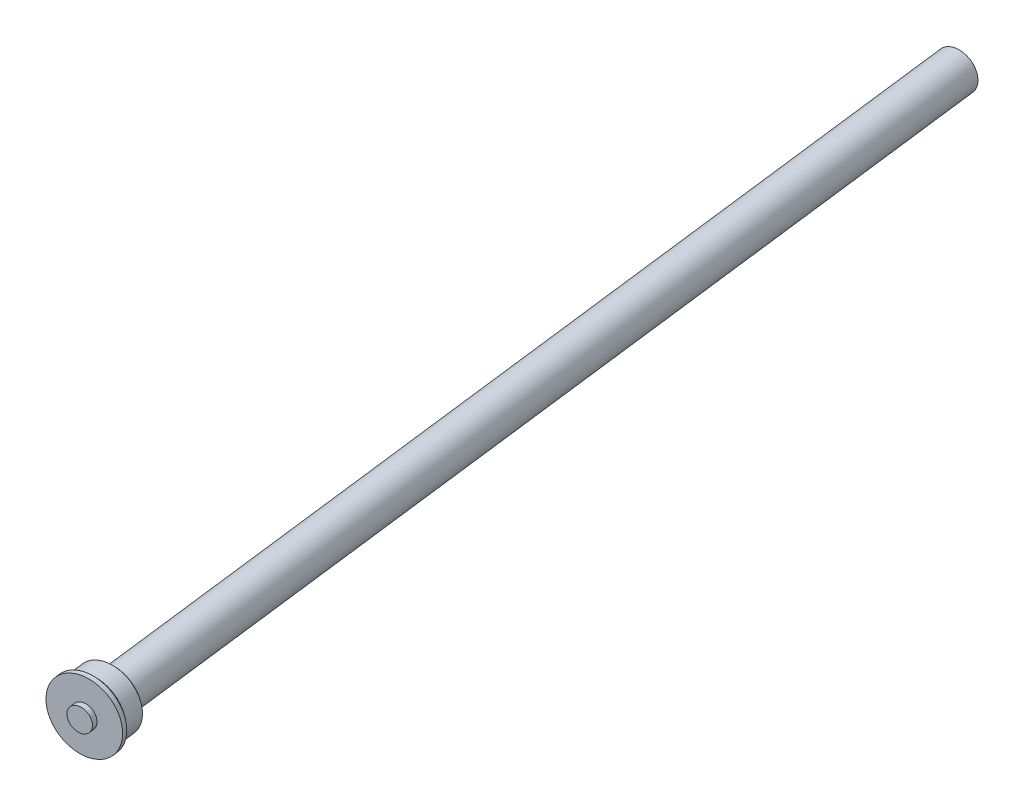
ISO-10303-21;
HEADER;
FILE_DESCRIPTION(('STEP AP214'),'2;1');
FILE_NAME('part.step','',(''),(''),'','','');
FILE_SCHEMA(('AUTOMOTIVE_DESIGN { 1 0 10303 214 1 1 1 1 }'));
ENDSEC;
DATA;
#1=APPLICATION_CONTEXT('core data for automotive mechanical design processes');
#2=APPLICATION_PROTOCOL_DEFINITION('international standard','automotive_design',2000,#1);
#3=PRODUCT_CONTEXT('',#1,'mechanical');
#4=PRODUCT('Part','Part','',(#3));
#5=PRODUCT_RELATED_PRODUCT_CATEGORY('part','',(#4));
#6=PRODUCT_DEFINITION_FORMATION('','',#4);
#7=PRODUCT_DEFINITION_CONTEXT('part definition',#1,'design');
#8=PRODUCT_DEFINITION('design','',#6,#7);
#9=PRODUCT_DEFINITION_SHAPE('','',#8);
#10=(LENGTH_UNIT() NAMED_UNIT(*) SI_UNIT(.MILLI.,.METRE.));
#11=(NAMED_UNIT(*) PLANE_ANGLE_UNIT() SI_UNIT($,.RADIAN.));
#12=(NAMED_UNIT(*) SI_UNIT($,.STERADIAN.) SOLID_ANGLE_UNIT());
#13=UNCERTAINTY_MEASURE_WITH_UNIT(LENGTH_MEASURE(1.E-05),#10,'distance_accuracy_value','');
#14=(GEOMETRIC_REPRESENTATION_CONTEXT(3) GLOBAL_UNCERTAINTY_ASSIGNED_CONTEXT((#13)) GLOBAL_UNIT_ASSIGNED_CONTEXT((#10,
#11,#12)) REPRESENTATION_CONTEXT('',''));
#15=CARTESIAN_POINT('',(0.,0.,0.));
#16=DIRECTION('',(0.,0.,1.));
#17=DIRECTION('',(1.,0.,0.));
#18=AXIS2_PLACEMENT_3D('',#15,#16,#17);
#19=CARTESIAN_POINT('',(92.8753429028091,-2.85362011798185E-13,-206.071733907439));
#20=DIRECTION('',(0.122564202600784,0.,0.992460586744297));
#21=DIRECTION('',(-0.992407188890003,0.0103732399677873,0.122557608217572));
#22=AXIS2_PLACEMENT_3D('',#19,#20,#21);
#23=CONICAL_SURFACE('',#22,19.,0.785398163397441);
#24=CARTESIAN_POINT('',(92.9979071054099,-2.86012533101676E-13,-205.079273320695));
#25=DIRECTION('',(-0.122564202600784,0.,-0.992460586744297));
#26=DIRECTION('',(0.992407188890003,-0.0103732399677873,-0.122557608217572));
#27=AXIS2_PLACEMENT_3D('',#24,#25,#26);
#28=CIRCLE('',#27,20.);
#29=CARTESIAN_POINT('',(112.84605088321,-0.207464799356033,-207.530425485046));
#30=VERTEX_POINT('',#29);
#31=EDGE_CURVE('E28',#30,#30,#28,.F.);
#32=ORIENTED_EDGE('',*,*,#31,.F.);
#33=EDGE_LOOP('',(#32));
#34=FACE_BOUND('',#33,.T.);
#35=CARTESIAN_POINT('',(92.8753429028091,-2.85362011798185E-13,-206.071733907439));
#36=DIRECTION('',(-0.122564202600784,0.,-0.992460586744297));
#37=DIRECTION('',(0.992407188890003,-0.0103732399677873,-0.122557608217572));
#38=AXIS2_PLACEMENT_3D('',#35,#36,#37);
#39=CIRCLE('',#38,19.);
#40=CARTESIAN_POINT('',(111.731079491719,-0.197091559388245,-208.400328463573));
#41=VERTEX_POINT('',#40);
#42=EDGE_CURVE('E33',#41,#41,#39,.T.);
#43=ORIENTED_EDGE('',*,*,#42,.F.);
#44=EDGE_LOOP('',(#43));
#45=FACE_BOUND('',#44,.T.);
#46=ADVANCED_FACE('F16',(#34,#45),#23,.T.);
#47=CARTESIAN_POINT('',(94.5299596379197,-2.88614618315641E-13,-192.673515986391));
#48=DIRECTION('',(0.122564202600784,0.,0.992460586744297));
#49=DIRECTION('',(-0.992407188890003,0.0103732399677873,0.122557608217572));
#50=AXIS2_PLACEMENT_3D('',#47,#48,#49);
#51=CONICAL_SURFACE('',#50,20.,0.785398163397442);
#52=CARTESIAN_POINT('',(94.8363701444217,-2.88831458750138E-13,-190.19236451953));
#53=DIRECTION('',(-0.122564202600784,0.,-0.992460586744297));
#54=DIRECTION('',(0.992407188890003,-0.0103732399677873,-0.122557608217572));
#55=AXIS2_PLACEMENT_3D('',#52,#53,#54);
#56=CIRCLE('',#55,22.5);
#57=CARTESIAN_POINT('',(117.165531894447,-0.233397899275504,-192.949910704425));
#58=VERTEX_POINT('',#57);
#59=EDGE_CURVE('E39',#58,#58,#56,.T.);
#60=ORIENTED_EDGE('',*,*,#59,.T.);
#61=EDGE_LOOP('',(#60));
#62=FACE_BOUND('',#61,.T.);
#63=CARTESIAN_POINT('',(94.5299596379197,-2.88614618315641E-13,-192.673515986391));
#64=DIRECTION('',(-0.122564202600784,0.,-0.992460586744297));
#65=DIRECTION('',(0.992407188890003,-0.0103732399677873,-0.122557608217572));
#66=AXIS2_PLACEMENT_3D('',#63,#64,#65);
#67=CIRCLE('',#66,20.);
#68=CARTESIAN_POINT('',(114.37810341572,-0.207464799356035,-195.124668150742));
#69=VERTEX_POINT('',#68);
#70=EDGE_CURVE('E36',#69,#69,#67,.T.);
#71=ORIENTED_EDGE('',*,*,#70,.F.);
#72=EDGE_LOOP('',(#71));
#73=FACE_BOUND('',#72,.T.);
#74=ADVANCED_FACE('F66',(#62,#73),#51,.T.);
#75=CARTESIAN_POINT('',(92.5247680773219,-2.85145171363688E-13,-208.910504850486));
#76=DIRECTION('',(-0.122564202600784,0.,-0.992460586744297));
#77=DIRECTION('',(0.992407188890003,-0.0103732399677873,-0.122557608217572));
#78=AXIS2_PLACEMENT_3D('',#75,#76,#77);
#79=CYLINDRICAL_SURFACE('',#78,20.);
#80=ORIENTED_EDGE('',*,*,#31,.T.);
#81=EDGE_LOOP('',(#80));
#82=FACE_BOUND('',#81,.T.);
#83=ORIENTED_EDGE('',*,*,#70,.T.);
#84=EDGE_LOOP('',(#83));
#85=FACE_BOUND('',#84,.T.);
#86=ADVANCED_FACE('F73',(#82,#85),#79,.T.);
#87=CARTESIAN_POINT('',(95.2040627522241,-2.89698820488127E-13,-187.214982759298));
#88=DIRECTION('',(-0.122564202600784,0.,-0.992460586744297));
#89=DIRECTION('',(0.992407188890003,-0.0103732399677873,-0.122557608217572));
#90=AXIS2_PLACEMENT_3D('',#87,#88,#89);
#91=CYLINDRICAL_SURFACE('',#90,22.5);
#92=ORIENTED_EDGE('',*,*,#59,.F.);
#93=EDGE_LOOP('',(#92));
#94=FACE_BOUND('',#93,.T.);
#95=CARTESIAN_POINT('',(95.2199960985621,-2.89265139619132E-13,-187.08596288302));
#96=DIRECTION('',(-0.122564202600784,0.,-0.992460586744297));
#97=DIRECTION('',(-0.992407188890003,0.0103732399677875,0.122557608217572));
#98=AXIS2_PLACEMENT_3D('',#95,#96,#97);
#99=CIRCLE('',#98,22.5);
#100=CARTESIAN_POINT('',(72.890834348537,0.233397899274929,-184.328416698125));
#101=VERTEX_POINT('',#100);
#102=EDGE_CURVE('E42',#101,#101,#99,.T.);
#103=ORIENTED_EDGE('',*,*,#102,.T.);
#104=EDGE_LOOP('',(#103));
#105=FACE_BOUND('',#104,.T.);
#106=ADVANCED_FACE('F80',(#94,#105),#91,.T.);
#107=CARTESIAN_POINT('',(92.8753429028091,-2.85362011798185E-13,-206.071733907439));
#108=DIRECTION('',(-0.122564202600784,0.,-0.992460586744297));
#109=DIRECTION('',(0.992407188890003,-0.0103732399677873,-0.122557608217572));
#110=AXIS2_PLACEMENT_3D('',#107,#108,#109);
#111=PLANE('',#110);
#112=CARTESIAN_POINT('',(92.8753429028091,-2.85362011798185E-13,-206.071733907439));
#113=DIRECTION('',(-0.122564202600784,0.,-0.992460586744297));
#114=DIRECTION('',(-0.992407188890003,0.0103732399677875,0.122557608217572));
#115=AXIS2_PLACEMENT_3D('',#112,#113,#114);
#116=CIRCLE('',#115,12.5);
#117=CARTESIAN_POINT('',(80.4702530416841,0.129665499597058,-204.539763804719));
#118=VERTEX_POINT('',#117);
#119=EDGE_CURVE('E24',#118,#118,#116,.T.);
#120=ORIENTED_EDGE('',*,*,#119,.F.);
#121=EDGE_LOOP('',(#120));
#122=FACE_BOUND('',#121,.T.);
#123=ORIENTED_EDGE('',*,*,#42,.T.);
#124=EDGE_LOOP('',(#123));
#125=FACE_BOUND('',#124,.T.);
#126=ADVANCED_FACE('F86',(#122,#125),#111,.T.);
#127=CARTESIAN_POINT('',(10.4073648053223,-1.54390389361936E-13,-873.854138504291));
#128=DIRECTION('',(0.122564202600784,0.,0.992460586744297));
#129=DIRECTION('',(0.992407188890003,-0.0103732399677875,-0.122557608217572));
#130=AXIS2_PLACEMENT_3D('',#127,#128,#129);
#131=CYLINDRICAL_SURFACE('',#130,12.5);
#132=ORIENTED_EDGE('',*,*,#119,.T.);
#133=EDGE_LOOP('',(#132));
#134=FACE_BOUND('',#133,.T.);
#135=CARTESIAN_POINT('',(14.7406637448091,-1.61329283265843E-13,-838.765357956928));
#136=DIRECTION('',(0.122564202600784,0.,0.992460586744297));
#137=DIRECTION('',(0.992407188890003,-0.0103732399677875,-0.122557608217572));
#138=AXIS2_PLACEMENT_3D('',#135,#136,#137);
#139=CIRCLE('',#138,12.5);
#140=CARTESIAN_POINT('',(27.1457536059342,-0.129665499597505,-840.297328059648));
#141=VERTEX_POINT('',#140);
#142=EDGE_CURVE('E10',#141,#141,#139,.T.);
#143=ORIENTED_EDGE('',*,*,#142,.T.);
#144=EDGE_LOOP('',(#143));
#145=FACE_BOUND('',#144,.T.);
#146=ADVANCED_FACE('F83',(#134,#145),#131,.T.);
#147=CARTESIAN_POINT('',(14.7406637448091,-1.61112442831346E-13,-838.765357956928));
#148=DIRECTION('',(0.122564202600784,0.,0.992460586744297));
#149=DIRECTION('',(0.992407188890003,-0.0103732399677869,-0.122557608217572));
#150=AXIS2_PLACEMENT_3D('',#147,#148,#149);
#151=PLANE('',#150);
#152=ORIENTED_EDGE('',*,*,#142,.F.);
#153=EDGE_LOOP('',(#152));
#154=FACE_BOUND('',#153,.T.);
#155=ADVANCED_FACE('F61',(#154),#151,.F.);
#156=CARTESIAN_POINT('',(95.2199960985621,-2.89265139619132E-13,-187.08596288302));
#157=DIRECTION('',(-0.122564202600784,0.,-0.992460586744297));
#158=DIRECTION('',(0.992407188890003,-0.0103732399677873,-0.122557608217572));
#159=AXIS2_PLACEMENT_3D('',#156,#157,#158);
#160=PLANE('',#159);
#161=CARTESIAN_POINT('',(95.2199960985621,-2.89265139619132E-13,-187.08596288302));
#162=DIRECTION('',(-0.122564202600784,0.,-0.992460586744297));
#163=DIRECTION('',(-0.992407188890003,0.0103732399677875,0.122557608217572));
#164=AXIS2_PLACEMENT_3D('',#161,#162,#163);
#165=CIRCLE('',#164,7.5);
#166=CARTESIAN_POINT('',(87.7769421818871,0.0777992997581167,-186.166780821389));
#167=VERTEX_POINT('',#166);
#168=EDGE_CURVE('E20',#167,#167,#165,.F.);
#169=ORIENTED_EDGE('',*,*,#168,.F.);
#170=EDGE_LOOP('',(#169));
#171=FACE_BOUND('',#170,.T.);
#172=ORIENTED_EDGE('',*,*,#102,.F.);
#173=EDGE_LOOP('',(#172));
#174=FACE_BOUND('',#173,.T.);
#175=ADVANCED_FACE('F52',(#171,#174),#160,.F.);
#176=CARTESIAN_POINT('',(95.6330374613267,-2.89698820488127E-13,-183.741370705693));
#177=DIRECTION('',(0.122564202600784,0.,0.992460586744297));
#178=DIRECTION('',(0.992407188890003,-0.0103732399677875,-0.122557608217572));
#179=AXIS2_PLACEMENT_3D('',#176,#177,#178);
#180=CYLINDRICAL_SURFACE('',#179,7.5);
#181=ORIENTED_EDGE('',*,*,#168,.T.);
#182=EDGE_LOOP('',(#181));
#183=FACE_BOUND('',#182,.T.);
#184=CARTESIAN_POINT('',(95.6489708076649,-2.90132501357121E-13,-183.612350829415));
#185=DIRECTION('',(0.122564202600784,0.,0.992460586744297));
#186=DIRECTION('',(0.992407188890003,-0.0103732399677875,-0.122557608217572));
#187=AXIS2_PLACEMENT_3D('',#184,#185,#186);
#188=CIRCLE('',#187,7.5);
#189=CARTESIAN_POINT('',(103.09202472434,-0.0777992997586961,-184.531532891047));
#190=VERTEX_POINT('',#189);
#191=EDGE_CURVE('E45',#190,#190,#188,.T.);
#192=ORIENTED_EDGE('',*,*,#191,.F.);
#193=EDGE_LOOP('',(#192));
#194=FACE_BOUND('',#193,.T.);
#195=ADVANCED_FACE('F18',(#183,#194),#180,.T.);
#196=CARTESIAN_POINT('',(95.6489708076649,-2.90132501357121E-13,-183.612350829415));
#197=DIRECTION('',(0.122564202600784,0.,0.992460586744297));
#198=DIRECTION('',(0.992407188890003,-0.0103732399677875,-0.122557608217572));
#199=AXIS2_PLACEMENT_3D('',#196,#197,#198);
#200=PLANE('',#199);
#201=ORIENTED_EDGE('',*,*,#191,.T.);
#202=EDGE_LOOP('',(#201));
#203=FACE_BOUND('',#202,.T.);
#204=ADVANCED_FACE('F49',(#203),#200,.T.);
#205=CLOSED_SHELL('',(#46,#74,#86,#106,#126,#146,#155,#175,#195,#204));
#206=MANIFOLD_SOLID_BREP('B1',#205);
#207=ADVANCED_BREP_SHAPE_REPRESENTATION('',(#18,#206),#14);
#208=SHAPE_DEFINITION_REPRESENTATION(#9,#207);
ENDSEC;
END-ISO-10303-21;
